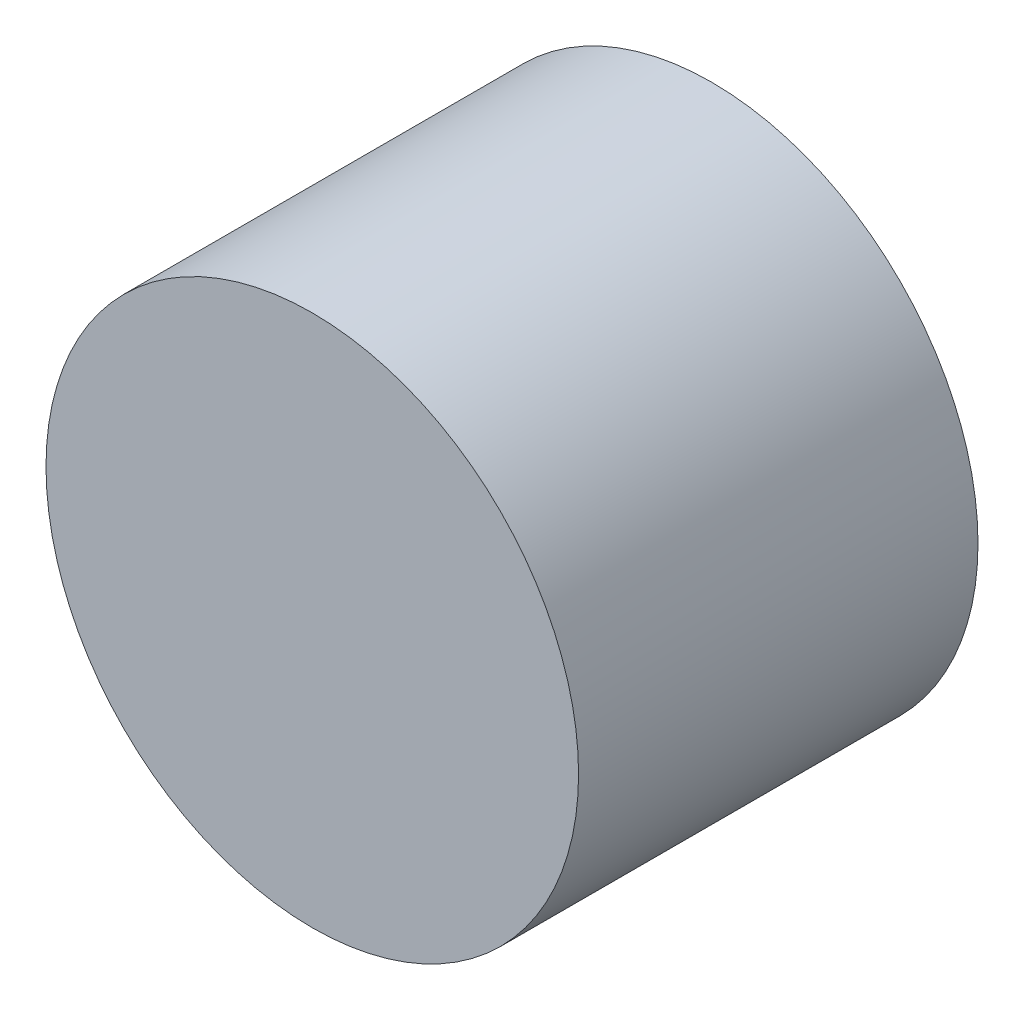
ISO-10303-21;
HEADER;
FILE_DESCRIPTION(('STEP AP214'),'2;1');
FILE_NAME('part.step','',(''),(''),'','','');
FILE_SCHEMA(('AUTOMOTIVE_DESIGN { 1 0 10303 214 1 1 1 1 }'));
ENDSEC;
DATA;
#1=APPLICATION_CONTEXT('core data for automotive mechanical design processes');
#2=APPLICATION_PROTOCOL_DEFINITION('international standard','automotive_design',2000,#1);
#3=PRODUCT_CONTEXT('',#1,'mechanical');
#4=PRODUCT('Part','Part','',(#3));
#5=PRODUCT_RELATED_PRODUCT_CATEGORY('part','',(#4));
#6=PRODUCT_DEFINITION_FORMATION('','',#4);
#7=PRODUCT_DEFINITION_CONTEXT('part definition',#1,'design');
#8=PRODUCT_DEFINITION('design','',#6,#7);
#9=PRODUCT_DEFINITION_SHAPE('','',#8);
#10=(LENGTH_UNIT() NAMED_UNIT(*) SI_UNIT(.MILLI.,.METRE.));
#11=(NAMED_UNIT(*) PLANE_ANGLE_UNIT() SI_UNIT($,.RADIAN.));
#12=(NAMED_UNIT(*) SI_UNIT($,.STERADIAN.) SOLID_ANGLE_UNIT());
#13=UNCERTAINTY_MEASURE_WITH_UNIT(LENGTH_MEASURE(1.E-05),#10,'distance_accuracy_value','');
#14=(GEOMETRIC_REPRESENTATION_CONTEXT(3) GLOBAL_UNCERTAINTY_ASSIGNED_CONTEXT((#13)) GLOBAL_UNIT_ASSIGNED_CONTEXT((#10,
#11,#12)) REPRESENTATION_CONTEXT('',''));
#15=CARTESIAN_POINT('',(0.,0.,0.));
#16=DIRECTION('',(0.,0.,1.));
#17=DIRECTION('',(1.,0.,0.));
#18=AXIS2_PLACEMENT_3D('',#15,#16,#17);
#19=CARTESIAN_POINT('',(0.,0.,75.));
#20=DIRECTION('',(0.,0.,-1.));
#21=DIRECTION('',(-1.,0.,0.));
#22=AXIS2_PLACEMENT_3D('',#19,#20,#21);
#23=CYLINDRICAL_SURFACE('',#22,100.);
#24=CARTESIAN_POINT('',(0.,0.,-75.));
#25=DIRECTION('',(0.,0.,1.));
#26=DIRECTION('',(1.,0.,0.));
#27=AXIS2_PLACEMENT_3D('',#24,#25,#26);
#28=CIRCLE('',#27,100.);
#29=CARTESIAN_POINT('',(100.,0.,-75.));
#30=VERTEX_POINT('',#29);
#31=EDGE_CURVE('E36',#30,#30,#28,.T.);
#32=ORIENTED_EDGE('',*,*,#31,.T.);
#33=EDGE_LOOP('',(#32));
#34=FACE_BOUND('',#33,.T.);
#35=CARTESIAN_POINT('',(0.,0.,75.));
#36=DIRECTION('',(0.,0.,1.));
#37=DIRECTION('',(-1.,0.,0.));
#38=AXIS2_PLACEMENT_3D('',#35,#36,#37);
#39=CIRCLE('',#38,100.);
#40=CARTESIAN_POINT('',(-100.,0.,75.));
#41=VERTEX_POINT('',#40);
#42=EDGE_CURVE('E10',#41,#41,#39,.T.);
#43=ORIENTED_EDGE('',*,*,#42,.F.);
#44=EDGE_LOOP('',(#43));
#45=FACE_BOUND('',#44,.T.);
#46=ADVANCED_FACE('F30',(#34,#45),#23,.T.);
#47=CARTESIAN_POINT('',(0.,0.,75.));
#48=DIRECTION('',(0.,0.,-1.));
#49=DIRECTION('',(-1.,0.,0.));
#50=AXIS2_PLACEMENT_3D('',#47,#48,#49);
#51=PLANE('',#50);
#52=ORIENTED_EDGE('',*,*,#42,.T.);
#53=EDGE_LOOP('',(#52));
#54=FACE_BOUND('',#53,.T.);
#55=ADVANCED_FACE('F46',(#54),#51,.F.);
#56=CARTESIAN_POINT('',(0.,0.,-75.));
#57=DIRECTION('',(0.,0.,-1.));
#58=DIRECTION('',(-1.,0.,0.));
#59=AXIS2_PLACEMENT_3D('',#56,#57,#58);
#60=PLANE('',#59);
#61=ORIENTED_EDGE('',*,*,#31,.F.);
#62=EDGE_LOOP('',(#61));
#63=FACE_BOUND('',#62,.T.);
#64=ADVANCED_FACE('F44',(#63),#60,.T.);
#65=CLOSED_SHELL('',(#46,#55,#64));
#66=MANIFOLD_SOLID_BREP('B2',#65);
#67=ADVANCED_BREP_SHAPE_REPRESENTATION('',(#18,#66),#14);
#68=SHAPE_DEFINITION_REPRESENTATION(#9,#67);
ENDSEC;
END-ISO-10303-21;
